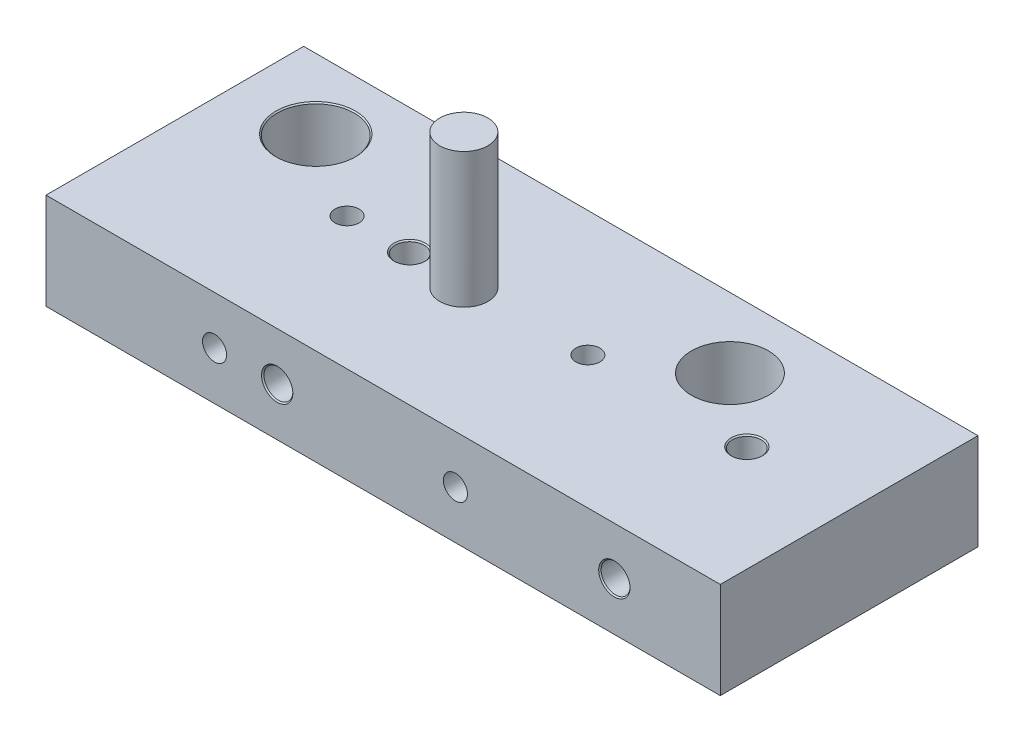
ISO-10303-21;
HEADER;
FILE_DESCRIPTION(('STEP AP214'),'2;1');
FILE_NAME('part.step','',(''),(''),'','','');
FILE_SCHEMA(('AUTOMOTIVE_DESIGN { 1 0 10303 214 1 1 1 1 }'));
ENDSEC;
DATA;
#1=APPLICATION_CONTEXT('core data for automotive mechanical design processes');
#2=APPLICATION_PROTOCOL_DEFINITION('international standard','automotive_design',2000,#1);
#3=PRODUCT_CONTEXT('',#1,'mechanical');
#4=PRODUCT('Part','Part','',(#3));
#5=PRODUCT_RELATED_PRODUCT_CATEGORY('part','',(#4));
#6=PRODUCT_DEFINITION_FORMATION('','',#4);
#7=PRODUCT_DEFINITION_CONTEXT('part definition',#1,'design');
#8=PRODUCT_DEFINITION('design','',#6,#7);
#9=PRODUCT_DEFINITION_SHAPE('','',#8);
#10=(LENGTH_UNIT() NAMED_UNIT(*) SI_UNIT(.MILLI.,.METRE.));
#11=(NAMED_UNIT(*) PLANE_ANGLE_UNIT() SI_UNIT($,.RADIAN.));
#12=(NAMED_UNIT(*) SI_UNIT($,.STERADIAN.) SOLID_ANGLE_UNIT());
#13=UNCERTAINTY_MEASURE_WITH_UNIT(LENGTH_MEASURE(1.E-05),#10,'distance_accuracy_value','');
#14=(GEOMETRIC_REPRESENTATION_CONTEXT(3) GLOBAL_UNCERTAINTY_ASSIGNED_CONTEXT((#13)) GLOBAL_UNIT_ASSIGNED_CONTEXT((#10,
#11,#12)) REPRESENTATION_CONTEXT('',''));
#15=CARTESIAN_POINT('',(0.,0.,0.));
#16=DIRECTION('',(0.,0.,1.));
#17=DIRECTION('',(1.,0.,0.));
#18=AXIS2_PLACEMENT_3D('',#15,#16,#17);
#19=CARTESIAN_POINT('',(0.,20.,-53.5));
#20=DIRECTION('',(0.,-1.,0.));
#21=DIRECTION('',(0.,0.,-1.));
#22=AXIS2_PLACEMENT_3D('',#19,#20,#21);
#23=PLANE('',#22);
#24=CARTESIAN_POINT('',(103.,20.,-39.));
#25=DIRECTION('',(0.,-1.,0.));
#26=DIRECTION('',(0.,0.,-1.));
#27=AXIS2_PLACEMENT_3D('',#24,#25,#26);
#28=CIRCLE('',#27,7.99999999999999);
#29=CARTESIAN_POINT('',(103.,20.,-47.));
#30=VERTEX_POINT('',#29);
#31=EDGE_CURVE('E9178',#30,#30,#28,.T.);
#32=ORIENTED_EDGE('',*,*,#31,.T.);
#33=EDGE_LOOP('',(#32));
#34=FACE_BOUND('',#33,.T.);
#35=DIRECTION('',(0.,0.,1.));
#36=VECTOR('',#35,1.);
#37=CARTESIAN_POINT('',(0.,20.,0.));
#38=LINE('',#37,#36);
#39=CARTESIAN_POINT('',(0.,20.,-53.5));
#40=VERTEX_POINT('',#39);
#41=CARTESIAN_POINT('',(0.,20.,0.));
#42=VERTEX_POINT('',#41);
#43=EDGE_CURVE('E9306',#40,#42,#38,.T.);
#44=ORIENTED_EDGE('',*,*,#43,.T.);
#45=DIRECTION('',(1.,0.,0.));
#46=VECTOR('',#45,1.);
#47=CARTESIAN_POINT('',(0.,20.,0.));
#48=LINE('',#47,#46);
#49=CARTESIAN_POINT('',(140.,20.,0.));
#50=VERTEX_POINT('',#49);
#51=EDGE_CURVE('E9304',#42,#50,#48,.T.);
#52=ORIENTED_EDGE('',*,*,#51,.T.);
#53=DIRECTION('',(0.,0.,-1.));
#54=VECTOR('',#53,1.);
#55=CARTESIAN_POINT('',(140.,20.,0.));
#56=LINE('',#55,#54);
#57=CARTESIAN_POINT('',(140.,20.,-53.5));
#58=VERTEX_POINT('',#57);
#59=EDGE_CURVE('E9302',#50,#58,#56,.T.);
#60=ORIENTED_EDGE('',*,*,#59,.T.);
#61=DIRECTION('',(-1.,0.,0.));
#62=VECTOR('',#61,1.);
#63=CARTESIAN_POINT('',(0.,20.,-53.5));
#64=LINE('',#63,#62);
#65=EDGE_CURVE('E9300',#58,#40,#64,.T.);
#66=ORIENTED_EDGE('',*,*,#65,.T.);
#67=EDGE_LOOP('',(#44,#52,#60,#66));
#68=FACE_BOUND('',#67,.T.);
#69=CARTESIAN_POINT('',(17.,20.,-39.));
#70=DIRECTION('',(0.,-1.,0.));
#71=DIRECTION('',(0.,0.,-1.));
#72=AXIS2_PLACEMENT_3D('',#69,#70,#71);
#73=CIRCLE('',#72,8.24999999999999);
#74=CARTESIAN_POINT('',(17.,20.,-47.25));
#75=VERTEX_POINT('',#74);
#76=EDGE_CURVE('E9327',#75,#75,#73,.T.);
#77=ORIENTED_EDGE('',*,*,#76,.T.);
#78=EDGE_LOOP('',(#77));
#79=FACE_BOUND('',#78,.T.);
#80=CARTESIAN_POINT('',(35.,20.,-27.5));
#81=DIRECTION('',(0.,-1.,0.));
#82=DIRECTION('',(0.,0.,-1.));
#83=AXIS2_PLACEMENT_3D('',#80,#81,#82);
#84=CIRCLE('',#83,2.5);
#85=CARTESIAN_POINT('',(35.,20.,-30.));
#86=VERTEX_POINT('',#85);
#87=EDGE_CURVE('E9333',#86,#86,#84,.T.);
#88=ORIENTED_EDGE('',*,*,#87,.T.);
#89=EDGE_LOOP('',(#88));
#90=FACE_BOUND('',#89,.T.);
#91=CARTESIAN_POINT('',(85.,20.,-27.5));
#92=DIRECTION('',(0.,-1.,0.));
#93=DIRECTION('',(0.,0.,-1.));
#94=AXIS2_PLACEMENT_3D('',#91,#92,#93);
#95=CIRCLE('',#94,2.49999999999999);
#96=CARTESIAN_POINT('',(85.,20.,-30.));
#97=VERTEX_POINT('',#96);
#98=EDGE_CURVE('E9339',#97,#97,#95,.T.);
#99=ORIENTED_EDGE('',*,*,#98,.T.);
#100=EDGE_LOOP('',(#99));
#101=FACE_BOUND('',#100,.T.);
#102=CARTESIAN_POINT('',(48.,20.,-27.5));
#103=DIRECTION('',(0.,-1.,0.));
#104=DIRECTION('',(0.,0.,-1.));
#105=AXIS2_PLACEMENT_3D('',#102,#103,#104);
#106=CIRCLE('',#105,3.25);
#107=CARTESIAN_POINT('',(48.,20.,-30.75));
#108=VERTEX_POINT('',#107);
#109=EDGE_CURVE('E9351',#108,#108,#106,.T.);
#110=ORIENTED_EDGE('',*,*,#109,.T.);
#111=EDGE_LOOP('',(#110));
#112=FACE_BOUND('',#111,.T.);
#113=CARTESIAN_POINT('',(118.,20.,-27.5));
#114=DIRECTION('',(0.,-1.,0.));
#115=DIRECTION('',(0.,0.,-1.));
#116=AXIS2_PLACEMENT_3D('',#113,#114,#115);
#117=CIRCLE('',#116,3.24999999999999);
#118=CARTESIAN_POINT('',(118.,20.,-30.75));
#119=VERTEX_POINT('',#118);
#120=EDGE_CURVE('E9363',#119,#119,#117,.T.);
#121=ORIENTED_EDGE('',*,*,#120,.T.);
#122=EDGE_LOOP('',(#121));
#123=FACE_BOUND('',#122,.T.);
#124=CARTESIAN_POINT('',(60.,20.,-26.75));
#125=DIRECTION('',(0.,-1.,0.));
#126=DIRECTION('',(0.,0.,-1.));
#127=AXIS2_PLACEMENT_3D('',#124,#125,#126);
#128=CIRCLE('',#127,5.);
#129=CARTESIAN_POINT('',(60.,20.,-31.75));
#130=VERTEX_POINT('',#129);
#131=EDGE_CURVE('E11',#130,#130,#128,.F.);
#132=ORIENTED_EDGE('',*,*,#131,.F.);
#133=EDGE_LOOP('',(#132));
#134=FACE_BOUND('',#133,.T.);
#135=ADVANCED_FACE('F9174',(#34,#68,#79,#90,#101,#112,#123,#134),#23,.F.);
#136=CARTESIAN_POINT('',(85.,0.,-27.5));
#137=DIRECTION('',(0.,-1.,0.));
#138=DIRECTION('',(0.,0.,-1.));
#139=AXIS2_PLACEMENT_3D('',#136,#137,#138);
#140=CYLINDRICAL_SURFACE('',#139,2.49999999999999);
#141=CARTESIAN_POINT('',(85.,0.,-27.5));
#142=DIRECTION('',(0.,-1.,0.));
#143=DIRECTION('',(0.,0.,-1.));
#144=AXIS2_PLACEMENT_3D('',#141,#142,#143);
#145=CIRCLE('',#144,2.49999999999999);
#146=CARTESIAN_POINT('',(85.,0.,-30.));
#147=VERTEX_POINT('',#146);
#148=EDGE_CURVE('E9336',#147,#147,#145,.T.);
#149=ORIENTED_EDGE('',*,*,#148,.T.);
#150=EDGE_LOOP('',(#149));
#151=FACE_BOUND('',#150,.T.);
#152=CARTESIAN_POINT('',(85.,10.,-27.5));
#153=DIRECTION('',(0.,-0.707106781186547,-0.707106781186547));
#154=DIRECTION('',(0.,-0.707106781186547,0.707106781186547));
#155=AXIS2_PLACEMENT_3D('',#152,#153,#154);
#156=ELLIPSE('',#155,3.53553390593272,2.49999999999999);
#157=CARTESIAN_POINT('',(82.5,10.,-27.5));
#158=VERTEX_POINT('',#157);
#159=CARTESIAN_POINT('',(87.5,10.,-27.5));
#160=VERTEX_POINT('',#159);
#161=EDGE_CURVE('E9189',#158,#160,#156,.F.);
#162=ORIENTED_EDGE('',*,*,#161,.T.);
#163=CARTESIAN_POINT('',(85.,10.,-27.5));
#164=DIRECTION('',(0.,-0.707106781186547,0.707106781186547));
#165=DIRECTION('',(0.,-0.707106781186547,-0.707106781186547));
#166=AXIS2_PLACEMENT_3D('',#163,#164,#165);
#167=ELLIPSE('',#166,3.53553390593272,2.49999999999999);
#168=EDGE_CURVE('E9183',#160,#158,#167,.F.);
#169=ORIENTED_EDGE('',*,*,#168,.T.);
#170=EDGE_LOOP('',(#162,#169));
#171=FACE_BOUND('',#170,.T.);
#172=ADVANCED_FACE('F9252',(#151,#171),#140,.F.);
#173=CARTESIAN_POINT('',(35.,0.,-27.5));
#174=DIRECTION('',(0.,-1.,0.));
#175=DIRECTION('',(0.,0.,-1.));
#176=AXIS2_PLACEMENT_3D('',#173,#174,#175);
#177=CYLINDRICAL_SURFACE('',#176,2.49999999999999);
#178=CARTESIAN_POINT('',(35.,0.,-27.5));
#179=DIRECTION('',(0.,-1.,0.));
#180=DIRECTION('',(0.,0.,-1.));
#181=AXIS2_PLACEMENT_3D('',#178,#179,#180);
#182=CIRCLE('',#181,2.49999999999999);
#183=CARTESIAN_POINT('',(35.,0.,-30.));
#184=VERTEX_POINT('',#183);
#185=EDGE_CURVE('E9330',#184,#184,#182,.T.);
#186=ORIENTED_EDGE('',*,*,#185,.T.);
#187=EDGE_LOOP('',(#186));
#188=FACE_BOUND('',#187,.T.);
#189=CARTESIAN_POINT('',(35.,10.,-27.5));
#190=DIRECTION('',(0.,-0.707106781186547,-0.707106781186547));
#191=DIRECTION('',(0.,-0.707106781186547,0.707106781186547));
#192=AXIS2_PLACEMENT_3D('',#189,#190,#191);
#193=ELLIPSE('',#192,3.53553390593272,2.49999999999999);
#194=CARTESIAN_POINT('',(32.5,10.,-27.5));
#195=VERTEX_POINT('',#194);
#196=CARTESIAN_POINT('',(37.5,10.,-27.5));
#197=VERTEX_POINT('',#196);
#198=EDGE_CURVE('E9196',#195,#197,#193,.F.);
#199=ORIENTED_EDGE('',*,*,#198,.T.);
#200=CARTESIAN_POINT('',(35.,10.,-27.5));
#201=DIRECTION('',(0.,-0.707106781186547,0.707106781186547));
#202=DIRECTION('',(0.,-0.707106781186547,-0.707106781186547));
#203=AXIS2_PLACEMENT_3D('',#200,#201,#202);
#204=ELLIPSE('',#203,3.53553390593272,2.49999999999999);
#205=EDGE_CURVE('E9250',#197,#195,#204,.F.);
#206=ORIENTED_EDGE('',*,*,#205,.T.);
#207=EDGE_LOOP('',(#199,#206));
#208=FACE_BOUND('',#207,.T.);
#209=ADVANCED_FACE('F9549',(#188,#208),#177,.F.);
#210=CARTESIAN_POINT('',(118.,0.,-27.5));
#211=DIRECTION('',(0.,-1.,0.));
#212=DIRECTION('',(0.,0.,-1.));
#213=AXIS2_PLACEMENT_3D('',#210,#211,#212);
#214=CYLINDRICAL_SURFACE('',#213,3.);
#215=CARTESIAN_POINT('',(118.,0.250000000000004,-27.5));
#216=DIRECTION('',(0.,-1.,0.));
#217=DIRECTION('',(0.,0.,-1.));
#218=AXIS2_PLACEMENT_3D('',#215,#216,#217);
#219=CIRCLE('',#218,3.);
#220=CARTESIAN_POINT('',(118.,0.250000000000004,-30.5));
#221=VERTEX_POINT('',#220);
#222=EDGE_CURVE('E9357',#221,#221,#219,.T.);
#223=ORIENTED_EDGE('',*,*,#222,.T.);
#224=EDGE_LOOP('',(#223));
#225=FACE_BOUND('',#224,.T.);
#226=CARTESIAN_POINT('',(118.,10.,-27.5));
#227=DIRECTION('',(0.,-0.707106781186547,-0.707106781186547));
#228=DIRECTION('',(0.,-0.707106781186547,0.707106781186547));
#229=AXIS2_PLACEMENT_3D('',#226,#227,#228);
#230=ELLIPSE('',#229,4.24264068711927,2.99999999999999);
#231=CARTESIAN_POINT('',(115.,10.,-27.5));
#232=VERTEX_POINT('',#231);
#233=CARTESIAN_POINT('',(121.,10.,-27.5));
#234=VERTEX_POINT('',#233);
#235=EDGE_CURVE('E9275',#232,#234,#230,.F.);
#236=ORIENTED_EDGE('',*,*,#235,.T.);
#237=CARTESIAN_POINT('',(118.,10.,-27.5));
#238=DIRECTION('',(0.,-0.707106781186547,0.707106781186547));
#239=DIRECTION('',(0.,-0.707106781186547,-0.707106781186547));
#240=AXIS2_PLACEMENT_3D('',#237,#238,#239);
#241=ELLIPSE('',#240,4.24264068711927,2.99999999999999);
#242=EDGE_CURVE('E9266',#234,#232,#241,.F.);
#243=ORIENTED_EDGE('',*,*,#242,.T.);
#244=EDGE_LOOP('',(#236,#243));
#245=FACE_BOUND('',#244,.T.);
#246=ADVANCED_FACE('F9525',(#225,#245),#214,.F.);
#247=CARTESIAN_POINT('',(48.,0.,-27.5));
#248=DIRECTION('',(0.,-1.,0.));
#249=DIRECTION('',(0.,0.,-1.));
#250=AXIS2_PLACEMENT_3D('',#247,#248,#249);
#251=CYLINDRICAL_SURFACE('',#250,3.);
#252=CARTESIAN_POINT('',(48.,0.250000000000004,-27.5));
#253=DIRECTION('',(0.,-1.,0.));
#254=DIRECTION('',(0.,0.,-1.));
#255=AXIS2_PLACEMENT_3D('',#252,#253,#254);
#256=CIRCLE('',#255,3.);
#257=CARTESIAN_POINT('',(48.,0.250000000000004,-30.5));
#258=VERTEX_POINT('',#257);
#259=EDGE_CURVE('E9345',#258,#258,#256,.T.);
#260=ORIENTED_EDGE('',*,*,#259,.T.);
#261=EDGE_LOOP('',(#260));
#262=FACE_BOUND('',#261,.T.);
#263=CARTESIAN_POINT('',(48.,10.,-27.5));
#264=DIRECTION('',(0.,-0.707106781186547,-0.707106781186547));
#265=DIRECTION('',(0.,-0.707106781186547,0.707106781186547));
#266=AXIS2_PLACEMENT_3D('',#263,#264,#265);
#267=ELLIPSE('',#266,4.24264068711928,2.99999999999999);
#268=CARTESIAN_POINT('',(45.,10.,-27.5));
#269=VERTEX_POINT('',#268);
#270=CARTESIAN_POINT('',(51.,10.,-27.5));
#271=VERTEX_POINT('',#270);
#272=EDGE_CURVE('E9286',#269,#271,#267,.F.);
#273=ORIENTED_EDGE('',*,*,#272,.T.);
#274=CARTESIAN_POINT('',(48.,10.,-27.5));
#275=DIRECTION('',(0.,-0.707106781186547,0.707106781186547));
#276=DIRECTION('',(0.,-0.707106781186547,-0.707106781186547));
#277=AXIS2_PLACEMENT_3D('',#274,#275,#276);
#278=ELLIPSE('',#277,4.24264068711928,2.99999999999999);
#279=EDGE_CURVE('E9277',#271,#269,#278,.F.);
#280=ORIENTED_EDGE('',*,*,#279,.T.);
#281=EDGE_LOOP('',(#273,#280));
#282=FACE_BOUND('',#281,.T.);
#283=ADVANCED_FACE('F9538',(#262,#282),#251,.F.);
#284=CARTESIAN_POINT('',(0.,20.,0.));
#285=DIRECTION('',(1.,0.,0.));
#286=DIRECTION('',(0.,0.,-1.));
#287=AXIS2_PLACEMENT_3D('',#284,#285,#286);
#288=PLANE('',#287);
#289=DIRECTION('',(0.,0.,1.));
#290=VECTOR('',#289,1.);
#291=CARTESIAN_POINT('',(0.,0.,0.));
#292=LINE('',#291,#290);
#293=CARTESIAN_POINT('',(0.,0.,-53.5));
#294=VERTEX_POINT('',#293);
#295=CARTESIAN_POINT('',(0.,0.,0.));
#296=VERTEX_POINT('',#295);
#297=EDGE_CURVE('E9315',#294,#296,#292,.T.);
#298=ORIENTED_EDGE('',*,*,#297,.T.);
#299=DIRECTION('',(0.,-1.,0.));
#300=VECTOR('',#299,1.);
#301=CARTESIAN_POINT('',(0.,20.,0.));
#302=LINE('',#301,#300);
#303=EDGE_CURVE('E9288',#42,#296,#302,.T.);
#304=ORIENTED_EDGE('',*,*,#303,.F.);
#305=ORIENTED_EDGE('',*,*,#43,.F.);
#306=DIRECTION('',(0.,-1.,0.));
#307=VECTOR('',#306,1.);
#308=CARTESIAN_POINT('',(0.,20.,-53.5));
#309=LINE('',#308,#307);
#310=EDGE_CURVE('E9297',#40,#294,#309,.T.);
#311=ORIENTED_EDGE('',*,*,#310,.T.);
#312=EDGE_LOOP('',(#298,#304,#305,#311));
#313=FACE_BOUND('',#312,.T.);
#314=ADVANCED_FACE('F9176',(#313),#288,.F.);
#315=CARTESIAN_POINT('',(0.,20.,0.));
#316=DIRECTION('',(0.,0.,-1.));
#317=DIRECTION('',(-1.,0.,0.));
#318=AXIS2_PLACEMENT_3D('',#315,#316,#317);
#319=PLANE('',#318);
#320=CARTESIAN_POINT('',(85.,10.,0.));
#321=DIRECTION('',(0.,0.,1.));
#322=DIRECTION('',(1.,0.,0.));
#323=AXIS2_PLACEMENT_3D('',#320,#321,#322);
#324=CIRCLE('',#323,2.49999999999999);
#325=CARTESIAN_POINT('',(87.5,10.,0.));
#326=VERTEX_POINT('',#325);
#327=EDGE_CURVE('E9396',#326,#326,#324,.T.);
#328=ORIENTED_EDGE('',*,*,#327,.F.);
#329=EDGE_LOOP('',(#328));
#330=FACE_BOUND('',#329,.T.);
#331=CARTESIAN_POINT('',(35.,10.,0.));
#332=DIRECTION('',(0.,0.,1.));
#333=DIRECTION('',(1.,0.,0.));
#334=AXIS2_PLACEMENT_3D('',#331,#332,#333);
#335=CIRCLE('',#334,2.49999999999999);
#336=CARTESIAN_POINT('',(37.5,10.,0.));
#337=VERTEX_POINT('',#336);
#338=EDGE_CURVE('E9390',#337,#337,#335,.T.);
#339=ORIENTED_EDGE('',*,*,#338,.F.);
#340=EDGE_LOOP('',(#339));
#341=FACE_BOUND('',#340,.T.);
#342=CARTESIAN_POINT('',(118.,10.,0.));
#343=DIRECTION('',(0.,0.,1.));
#344=DIRECTION('',(1.,0.,0.));
#345=AXIS2_PLACEMENT_3D('',#342,#343,#344);
#346=CIRCLE('',#345,3.25);
#347=CARTESIAN_POINT('',(121.25,10.,0.));
#348=VERTEX_POINT('',#347);
#349=EDGE_CURVE('E9378',#348,#348,#346,.T.);
#350=ORIENTED_EDGE('',*,*,#349,.F.);
#351=EDGE_LOOP('',(#350));
#352=FACE_BOUND('',#351,.T.);
#353=CARTESIAN_POINT('',(48.,10.,0.));
#354=DIRECTION('',(0.,0.,1.));
#355=DIRECTION('',(1.,0.,0.));
#356=AXIS2_PLACEMENT_3D('',#353,#354,#355);
#357=CIRCLE('',#356,3.25);
#358=CARTESIAN_POINT('',(51.25,10.,0.));
#359=VERTEX_POINT('',#358);
#360=EDGE_CURVE('E9366',#359,#359,#357,.T.);
#361=ORIENTED_EDGE('',*,*,#360,.F.);
#362=EDGE_LOOP('',(#361));
#363=FACE_BOUND('',#362,.T.);
#364=DIRECTION('',(1.,0.,0.));
#365=VECTOR('',#364,1.);
#366=CARTESIAN_POINT('',(0.,0.,0.));
#367=LINE('',#366,#365);
#368=CARTESIAN_POINT('',(140.,0.,0.));
#369=VERTEX_POINT('',#368);
#370=EDGE_CURVE('E9313',#296,#369,#367,.T.);
#371=ORIENTED_EDGE('',*,*,#370,.T.);
#372=DIRECTION('',(0.,-1.,0.));
#373=VECTOR('',#372,1.);
#374=CARTESIAN_POINT('',(140.,20.,0.));
#375=LINE('',#374,#373);
#376=EDGE_CURVE('E9291',#50,#369,#375,.T.);
#377=ORIENTED_EDGE('',*,*,#376,.F.);
#378=ORIENTED_EDGE('',*,*,#51,.F.);
#379=ORIENTED_EDGE('',*,*,#303,.T.);
#380=EDGE_LOOP('',(#371,#377,#378,#379));
#381=FACE_BOUND('',#380,.T.);
#382=ADVANCED_FACE('F9452',(#330,#341,#352,#363,#381),#319,.F.);
#383=CARTESIAN_POINT('',(140.,20.,0.));
#384=DIRECTION('',(-1.,0.,0.));
#385=DIRECTION('',(0.,0.,1.));
#386=AXIS2_PLACEMENT_3D('',#383,#384,#385);
#387=PLANE('',#386);
#388=DIRECTION('',(0.,0.,-1.));
#389=VECTOR('',#388,1.);
#390=CARTESIAN_POINT('',(140.,0.,0.));
#391=LINE('',#390,#389);
#392=CARTESIAN_POINT('',(140.,0.,-53.5));
#393=VERTEX_POINT('',#392);
#394=EDGE_CURVE('E9311',#369,#393,#391,.T.);
#395=ORIENTED_EDGE('',*,*,#394,.T.);
#396=DIRECTION('',(0.,-1.,0.));
#397=VECTOR('',#396,1.);
#398=CARTESIAN_POINT('',(140.,20.,-53.5));
#399=LINE('',#398,#397);
#400=EDGE_CURVE('E9294',#58,#393,#399,.T.);
#401=ORIENTED_EDGE('',*,*,#400,.F.);
#402=ORIENTED_EDGE('',*,*,#59,.F.);
#403=ORIENTED_EDGE('',*,*,#376,.T.);
#404=EDGE_LOOP('',(#395,#401,#402,#403));
#405=FACE_BOUND('',#404,.T.);
#406=ADVANCED_FACE('F9449',(#405),#387,.F.);
#407=CARTESIAN_POINT('',(0.,20.,-53.5));
#408=DIRECTION('',(0.,0.,1.));
#409=DIRECTION('',(1.,0.,0.));
#410=AXIS2_PLACEMENT_3D('',#407,#408,#409);
#411=PLANE('',#410);
#412=CARTESIAN_POINT('',(85.,10.,-53.5));
#413=DIRECTION('',(0.,0.,1.));
#414=DIRECTION('',(1.,0.,0.));
#415=AXIS2_PLACEMENT_3D('',#412,#413,#414);
#416=CIRCLE('',#415,2.49999999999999);
#417=CARTESIAN_POINT('',(87.5,10.,-53.5));
#418=VERTEX_POINT('',#417);
#419=EDGE_CURVE('E9399',#418,#418,#416,.T.);
#420=ORIENTED_EDGE('',*,*,#419,.T.);
#421=EDGE_LOOP('',(#420));
#422=FACE_BOUND('',#421,.T.);
#423=CARTESIAN_POINT('',(35.,10.,-53.5));
#424=DIRECTION('',(0.,0.,1.));
#425=DIRECTION('',(1.,0.,0.));
#426=AXIS2_PLACEMENT_3D('',#423,#424,#425);
#427=CIRCLE('',#426,2.49999999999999);
#428=CARTESIAN_POINT('',(37.5,10.,-53.5));
#429=VERTEX_POINT('',#428);
#430=EDGE_CURVE('E9393',#429,#429,#427,.T.);
#431=ORIENTED_EDGE('',*,*,#430,.T.);
#432=EDGE_LOOP('',(#431));
#433=FACE_BOUND('',#432,.T.);
#434=CARTESIAN_POINT('',(118.,10.,-53.5));
#435=DIRECTION('',(0.,0.,1.));
#436=DIRECTION('',(1.,0.,0.));
#437=AXIS2_PLACEMENT_3D('',#434,#435,#436);
#438=CIRCLE('',#437,3.24999999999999);
#439=CARTESIAN_POINT('',(121.25,10.,-53.5));
#440=VERTEX_POINT('',#439);
#441=EDGE_CURVE('E9387',#440,#440,#438,.T.);
#442=ORIENTED_EDGE('',*,*,#441,.T.);
#443=EDGE_LOOP('',(#442));
#444=FACE_BOUND('',#443,.T.);
#445=CARTESIAN_POINT('',(48.,10.,-53.5));
#446=DIRECTION('',(0.,0.,1.));
#447=DIRECTION('',(1.,0.,0.));
#448=AXIS2_PLACEMENT_3D('',#445,#446,#447);
#449=CIRCLE('',#448,3.24999999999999);
#450=CARTESIAN_POINT('',(51.25,10.,-53.5));
#451=VERTEX_POINT('',#450);
#452=EDGE_CURVE('E9375',#451,#451,#449,.T.);
#453=ORIENTED_EDGE('',*,*,#452,.T.);
#454=EDGE_LOOP('',(#453));
#455=FACE_BOUND('',#454,.T.);
#456=DIRECTION('',(-1.,0.,0.));
#457=VECTOR('',#456,1.);
#458=CARTESIAN_POINT('',(0.,0.,-53.5));
#459=LINE('',#458,#457);
#460=EDGE_CURVE('E9309',#393,#294,#459,.T.);
#461=ORIENTED_EDGE('',*,*,#460,.T.);
#462=ORIENTED_EDGE('',*,*,#310,.F.);
#463=ORIENTED_EDGE('',*,*,#65,.F.);
#464=ORIENTED_EDGE('',*,*,#400,.T.);
#465=EDGE_LOOP('',(#461,#462,#463,#464));
#466=FACE_BOUND('',#465,.T.);
#467=ADVANCED_FACE('F9425',(#422,#433,#444,#455,#466),#411,.F.);
#468=CARTESIAN_POINT('',(0.,0.,-53.5));
#469=DIRECTION('',(0.,-1.,0.));
#470=DIRECTION('',(0.,0.,-1.));
#471=AXIS2_PLACEMENT_3D('',#468,#469,#470);
#472=PLANE('',#471);
#473=CARTESIAN_POINT('',(103.,0.,-39.));
#474=DIRECTION('',(0.,-1.,0.));
#475=DIRECTION('',(0.,0.,-1.));
#476=AXIS2_PLACEMENT_3D('',#473,#474,#475);
#477=CIRCLE('',#476,8.25000000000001);
#478=CARTESIAN_POINT('',(103.,0.,-47.25));
#479=VERTEX_POINT('',#478);
#480=EDGE_CURVE('E9405',#479,#479,#477,.T.);
#481=ORIENTED_EDGE('',*,*,#480,.F.);
#482=EDGE_LOOP('',(#481));
#483=FACE_BOUND('',#482,.T.);
#484=CARTESIAN_POINT('',(118.,0.,-27.5));
#485=DIRECTION('',(0.,-1.,0.));
#486=DIRECTION('',(0.,0.,-1.));
#487=AXIS2_PLACEMENT_3D('',#484,#485,#486);
#488=CIRCLE('',#487,3.25);
#489=CARTESIAN_POINT('',(118.,0.,-30.75));
#490=VERTEX_POINT('',#489);
#491=EDGE_CURVE('E9354',#490,#490,#488,.T.);
#492=ORIENTED_EDGE('',*,*,#491,.F.);
#493=EDGE_LOOP('',(#492));
#494=FACE_BOUND('',#493,.T.);
#495=CARTESIAN_POINT('',(48.,0.,-27.5));
#496=DIRECTION('',(0.,-1.,0.));
#497=DIRECTION('',(0.,0.,-1.));
#498=AXIS2_PLACEMENT_3D('',#495,#496,#497);
#499=CIRCLE('',#498,3.25);
#500=CARTESIAN_POINT('',(48.,0.,-30.75));
#501=VERTEX_POINT('',#500);
#502=EDGE_CURVE('E9342',#501,#501,#499,.T.);
#503=ORIENTED_EDGE('',*,*,#502,.F.);
#504=EDGE_LOOP('',(#503));
#505=FACE_BOUND('',#504,.T.);
#506=ORIENTED_EDGE('',*,*,#148,.F.);
#507=EDGE_LOOP('',(#506));
#508=FACE_BOUND('',#507,.T.);
#509=ORIENTED_EDGE('',*,*,#185,.F.);
#510=EDGE_LOOP('',(#509));
#511=FACE_BOUND('',#510,.T.);
#512=CARTESIAN_POINT('',(17.,0.,-39.));
#513=DIRECTION('',(0.,-1.,0.));
#514=DIRECTION('',(0.,0.,-1.));
#515=AXIS2_PLACEMENT_3D('',#512,#513,#514);
#516=CIRCLE('',#515,8.25);
#517=CARTESIAN_POINT('',(17.,0.,-47.25));
#518=VERTEX_POINT('',#517);
#519=EDGE_CURVE('E9318',#518,#518,#516,.T.);
#520=ORIENTED_EDGE('',*,*,#519,.F.);
#521=EDGE_LOOP('',(#520));
#522=FACE_BOUND('',#521,.T.);
#523=ORIENTED_EDGE('',*,*,#297,.F.);
#524=ORIENTED_EDGE('',*,*,#460,.F.);
#525=ORIENTED_EDGE('',*,*,#394,.F.);
#526=ORIENTED_EDGE('',*,*,#370,.F.);
#527=EDGE_LOOP('',(#523,#524,#525,#526));
#528=FACE_BOUND('',#527,.T.);
#529=ADVANCED_FACE('F9421',(#483,#494,#505,#508,#511,#522,#528),#472,.T.);
#530=CARTESIAN_POINT('',(17.,0.,-39.));
#531=DIRECTION('',(0.,-1.,0.));
#532=DIRECTION('',(0.,0.,-1.));
#533=AXIS2_PLACEMENT_3D('',#530,#531,#532);
#534=CONICAL_SURFACE('',#533,8.25,0.785398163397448);
#535=CARTESIAN_POINT('',(17.,0.250000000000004,-39.));
#536=DIRECTION('',(0.,-1.,0.));
#537=DIRECTION('',(0.,0.,-1.));
#538=AXIS2_PLACEMENT_3D('',#535,#536,#537);
#539=CIRCLE('',#538,8.);
#540=CARTESIAN_POINT('',(17.,0.250000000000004,-47.));
#541=VERTEX_POINT('',#540);
#542=EDGE_CURVE('E9321',#541,#541,#539,.T.);
#543=ORIENTED_EDGE('',*,*,#542,.F.);
#544=EDGE_LOOP('',(#543));
#545=FACE_BOUND('',#544,.T.);
#546=ORIENTED_EDGE('',*,*,#519,.T.);
#547=EDGE_LOOP('',(#546));
#548=FACE_BOUND('',#547,.T.);
#549=ADVANCED_FACE('F9424',(#545,#548),#534,.F.);
#550=CARTESIAN_POINT('',(17.,0.,-39.));
#551=DIRECTION('',(0.,-1.,0.));
#552=DIRECTION('',(0.,0.,-1.));
#553=AXIS2_PLACEMENT_3D('',#550,#551,#552);
#554=CYLINDRICAL_SURFACE('',#553,7.99999999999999);
#555=CARTESIAN_POINT('',(17.,19.75,-39.));
#556=DIRECTION('',(0.,-1.,0.));
#557=DIRECTION('',(0.,0.,-1.));
#558=AXIS2_PLACEMENT_3D('',#555,#556,#557);
#559=CIRCLE('',#558,7.99999999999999);
#560=CARTESIAN_POINT('',(17.,19.75,-47.));
#561=VERTEX_POINT('',#560);
#562=EDGE_CURVE('E9324',#561,#561,#559,.T.);
#563=ORIENTED_EDGE('',*,*,#562,.F.);
#564=EDGE_LOOP('',(#563));
#565=FACE_BOUND('',#564,.T.);
#566=ORIENTED_EDGE('',*,*,#542,.T.);
#567=EDGE_LOOP('',(#566));
#568=FACE_BOUND('',#567,.T.);
#569=ADVANCED_FACE('F9552',(#565,#568),#554,.F.);
#570=CARTESIAN_POINT('',(17.,19.75,-39.));
#571=DIRECTION('',(0.,1.,0.));
#572=DIRECTION('',(0.,0.,1.));
#573=AXIS2_PLACEMENT_3D('',#570,#571,#572);
#574=CONICAL_SURFACE('',#573,7.99999999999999,0.785398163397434);
#575=ORIENTED_EDGE('',*,*,#76,.F.);
#576=EDGE_LOOP('',(#575));
#577=FACE_BOUND('',#576,.T.);
#578=ORIENTED_EDGE('',*,*,#562,.T.);
#579=EDGE_LOOP('',(#578));
#580=FACE_BOUND('',#579,.T.);
#581=ADVANCED_FACE('F9547',(#577,#580),#574,.F.);
#582=CARTESIAN_POINT('',(35.,10.,-27.5));
#583=DIRECTION('',(0.,-0.707106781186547,-0.707106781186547));
#584=DIRECTION('',(0.,-0.707106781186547,0.707106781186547));
#585=AXIS2_PLACEMENT_3D('',#582,#583,#584);
#586=ELLIPSE('',#585,3.53553390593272,2.49999999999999);
#587=EDGE_CURVE('E9262',#195,#197,#586,.T.);
#588=ORIENTED_EDGE('',*,*,#587,.T.);
#589=CARTESIAN_POINT('',(35.,10.,-27.5));
#590=DIRECTION('',(0.,-0.707106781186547,0.707106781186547));
#591=DIRECTION('',(0.,-0.707106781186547,-0.707106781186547));
#592=AXIS2_PLACEMENT_3D('',#589,#590,#591);
#593=ELLIPSE('',#592,3.53553390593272,2.49999999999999);
#594=EDGE_CURVE('E9259',#197,#195,#593,.T.);
#595=ORIENTED_EDGE('',*,*,#594,.T.);
#596=EDGE_LOOP('',(#588,#595));
#597=FACE_BOUND('',#596,.T.);
#598=ORIENTED_EDGE('',*,*,#87,.F.);
#599=EDGE_LOOP('',(#598));
#600=FACE_BOUND('',#599,.T.);
#601=ADVANCED_FACE('F9544',(#597,#600),#177,.F.);
#602=CARTESIAN_POINT('',(85.,10.,-27.5));
#603=DIRECTION('',(0.,-0.707106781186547,-0.707106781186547));
#604=DIRECTION('',(0.,-0.707106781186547,0.707106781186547));
#605=AXIS2_PLACEMENT_3D('',#602,#603,#604);
#606=ELLIPSE('',#605,3.53553390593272,2.49999999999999);
#607=EDGE_CURVE('E9242',#158,#160,#606,.T.);
#608=ORIENTED_EDGE('',*,*,#607,.T.);
#609=CARTESIAN_POINT('',(85.,10.,-27.5));
#610=DIRECTION('',(0.,-0.707106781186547,0.707106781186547));
#611=DIRECTION('',(0.,-0.707106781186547,-0.707106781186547));
#612=AXIS2_PLACEMENT_3D('',#609,#610,#611);
#613=ELLIPSE('',#612,3.53553390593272,2.49999999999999);
#614=EDGE_CURVE('E9246',#160,#158,#613,.T.);
#615=ORIENTED_EDGE('',*,*,#614,.T.);
#616=EDGE_LOOP('',(#608,#615));
#617=FACE_BOUND('',#616,.T.);
#618=ORIENTED_EDGE('',*,*,#98,.F.);
#619=EDGE_LOOP('',(#618));
#620=FACE_BOUND('',#619,.T.);
#621=ADVANCED_FACE('F9254',(#617,#620),#140,.F.);
#622=CARTESIAN_POINT('',(48.,0.,-27.5));
#623=DIRECTION('',(0.,-1.,0.));
#624=DIRECTION('',(0.,0.,-1.));
#625=AXIS2_PLACEMENT_3D('',#622,#623,#624);
#626=CONICAL_SURFACE('',#625,3.25,0.785398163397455);
#627=ORIENTED_EDGE('',*,*,#259,.F.);
#628=EDGE_LOOP('',(#627));
#629=FACE_BOUND('',#628,.T.);
#630=ORIENTED_EDGE('',*,*,#502,.T.);
#631=EDGE_LOOP('',(#630));
#632=FACE_BOUND('',#631,.T.);
#633=ADVANCED_FACE('F9536',(#629,#632),#626,.F.);
#634=CARTESIAN_POINT('',(48.,10.,-27.5));
#635=DIRECTION('',(0.,-0.707106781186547,-0.707106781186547));
#636=DIRECTION('',(0.,-0.707106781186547,0.707106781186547));
#637=AXIS2_PLACEMENT_3D('',#634,#635,#636);
#638=ELLIPSE('',#637,4.24264068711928,2.99999999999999);
#639=EDGE_CURVE('E9283',#269,#271,#638,.T.);
#640=ORIENTED_EDGE('',*,*,#639,.T.);
#641=CARTESIAN_POINT('',(48.,10.,-27.5));
#642=DIRECTION('',(0.,-0.707106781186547,0.707106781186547));
#643=DIRECTION('',(0.,-0.707106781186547,-0.707106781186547));
#644=AXIS2_PLACEMENT_3D('',#641,#642,#643);
#645=ELLIPSE('',#644,4.24264068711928,2.99999999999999);
#646=EDGE_CURVE('E9280',#271,#269,#645,.T.);
#647=ORIENTED_EDGE('',*,*,#646,.T.);
#648=EDGE_LOOP('',(#640,#647));
#649=FACE_BOUND('',#648,.T.);
#650=CARTESIAN_POINT('',(48.,19.75,-27.5));
#651=DIRECTION('',(0.,-1.,0.));
#652=DIRECTION('',(0.,0.,-1.));
#653=AXIS2_PLACEMENT_3D('',#650,#651,#652);
#654=CIRCLE('',#653,3.);
#655=CARTESIAN_POINT('',(48.,19.75,-30.5));
#656=VERTEX_POINT('',#655);
#657=EDGE_CURVE('E9348',#656,#656,#654,.T.);
#658=ORIENTED_EDGE('',*,*,#657,.F.);
#659=EDGE_LOOP('',(#658));
#660=FACE_BOUND('',#659,.T.);
#661=ADVANCED_FACE('F9532',(#649,#660),#251,.F.);
#662=CARTESIAN_POINT('',(48.,19.75,-27.5));
#663=DIRECTION('',(0.,1.,0.));
#664=DIRECTION('',(0.,0.,1.));
#665=AXIS2_PLACEMENT_3D('',#662,#663,#664);
#666=CONICAL_SURFACE('',#665,3.,0.785398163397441);
#667=ORIENTED_EDGE('',*,*,#109,.F.);
#668=EDGE_LOOP('',(#667));
#669=FACE_BOUND('',#668,.T.);
#670=ORIENTED_EDGE('',*,*,#657,.T.);
#671=EDGE_LOOP('',(#670));
#672=FACE_BOUND('',#671,.T.);
#673=ADVANCED_FACE('F9528',(#669,#672),#666,.F.);
#674=CARTESIAN_POINT('',(118.,0.,-27.5));
#675=DIRECTION('',(0.,-1.,0.));
#676=DIRECTION('',(0.,0.,-1.));
#677=AXIS2_PLACEMENT_3D('',#674,#675,#676);
#678=CONICAL_SURFACE('',#677,3.25,0.785398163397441);
#679=ORIENTED_EDGE('',*,*,#222,.F.);
#680=EDGE_LOOP('',(#679));
#681=FACE_BOUND('',#680,.T.);
#682=ORIENTED_EDGE('',*,*,#491,.T.);
#683=EDGE_LOOP('',(#682));
#684=FACE_BOUND('',#683,.T.);
#685=ADVANCED_FACE('F9523',(#681,#684),#678,.F.);
#686=CARTESIAN_POINT('',(118.,10.,-27.5));
#687=DIRECTION('',(0.,-0.707106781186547,-0.707106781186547));
#688=DIRECTION('',(0.,-0.707106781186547,0.707106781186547));
#689=AXIS2_PLACEMENT_3D('',#686,#687,#688);
#690=ELLIPSE('',#689,4.24264068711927,2.99999999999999);
#691=EDGE_CURVE('E9272',#232,#234,#690,.T.);
#692=ORIENTED_EDGE('',*,*,#691,.T.);
#693=CARTESIAN_POINT('',(118.,10.,-27.5));
#694=DIRECTION('',(0.,-0.707106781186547,0.707106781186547));
#695=DIRECTION('',(0.,-0.707106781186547,-0.707106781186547));
#696=AXIS2_PLACEMENT_3D('',#693,#694,#695);
#697=ELLIPSE('',#696,4.24264068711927,2.99999999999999);
#698=EDGE_CURVE('E9269',#234,#232,#697,.T.);
#699=ORIENTED_EDGE('',*,*,#698,.T.);
#700=EDGE_LOOP('',(#692,#699));
#701=FACE_BOUND('',#700,.T.);
#702=CARTESIAN_POINT('',(118.,19.75,-27.5));
#703=DIRECTION('',(0.,-1.,0.));
#704=DIRECTION('',(0.,0.,-1.));
#705=AXIS2_PLACEMENT_3D('',#702,#703,#704);
#706=CIRCLE('',#705,2.99999999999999);
#707=CARTESIAN_POINT('',(118.,19.75,-30.5));
#708=VERTEX_POINT('',#707);
#709=EDGE_CURVE('E9360',#708,#708,#706,.T.);
#710=ORIENTED_EDGE('',*,*,#709,.F.);
#711=EDGE_LOOP('',(#710));
#712=FACE_BOUND('',#711,.T.);
#713=ADVANCED_FACE('F9519',(#701,#712),#214,.F.);
#714=CARTESIAN_POINT('',(118.,19.75,-27.5));
#715=DIRECTION('',(0.,1.,0.));
#716=DIRECTION('',(0.,0.,1.));
#717=AXIS2_PLACEMENT_3D('',#714,#715,#716);
#718=CONICAL_SURFACE('',#717,2.99999999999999,0.785398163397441);
#719=ORIENTED_EDGE('',*,*,#120,.F.);
#720=EDGE_LOOP('',(#719));
#721=FACE_BOUND('',#720,.T.);
#722=ORIENTED_EDGE('',*,*,#709,.T.);
#723=EDGE_LOOP('',(#722));
#724=FACE_BOUND('',#723,.T.);
#725=ADVANCED_FACE('F9516',(#721,#724),#718,.F.);
#726=CARTESIAN_POINT('',(48.,10.,0.));
#727=DIRECTION('',(0.,0.,1.));
#728=DIRECTION('',(1.,0.,0.));
#729=AXIS2_PLACEMENT_3D('',#726,#727,#728);
#730=CYLINDRICAL_SURFACE('',#729,2.99999999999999);
#731=CARTESIAN_POINT('',(48.,10.,-0.250000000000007));
#732=DIRECTION('',(0.,0.,1.));
#733=DIRECTION('',(1.,0.,0.));
#734=AXIS2_PLACEMENT_3D('',#731,#732,#733);
#735=CIRCLE('',#734,3.);
#736=CARTESIAN_POINT('',(51.,10.,-0.250000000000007));
#737=VERTEX_POINT('',#736);
#738=EDGE_CURVE('E9369',#737,#737,#735,.T.);
#739=ORIENTED_EDGE('',*,*,#738,.T.);
#740=EDGE_LOOP('',(#739));
#741=FACE_BOUND('',#740,.T.);
#742=ORIENTED_EDGE('',*,*,#272,.F.);
#743=ORIENTED_EDGE('',*,*,#646,.F.);
#744=EDGE_LOOP('',(#742,#743));
#745=FACE_BOUND('',#744,.T.);
#746=ADVANCED_FACE('F9512',(#741,#745),#730,.F.);
#747=CARTESIAN_POINT('',(48.,10.,0.));
#748=DIRECTION('',(0.,0.,1.));
#749=DIRECTION('',(1.,0.,0.));
#750=AXIS2_PLACEMENT_3D('',#747,#748,#749);
#751=CONICAL_SURFACE('',#750,3.25,0.785398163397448);
#752=ORIENTED_EDGE('',*,*,#738,.F.);
#753=EDGE_LOOP('',(#752));
#754=FACE_BOUND('',#753,.T.);
#755=ORIENTED_EDGE('',*,*,#360,.T.);
#756=EDGE_LOOP('',(#755));
#757=FACE_BOUND('',#756,.T.);
#758=ADVANCED_FACE('F9510',(#754,#757),#751,.F.);
#759=CARTESIAN_POINT('',(48.,10.,-53.25));
#760=DIRECTION('',(0.,0.,1.));
#761=DIRECTION('',(1.,0.,0.));
#762=AXIS2_PLACEMENT_3D('',#759,#760,#761);
#763=CIRCLE('',#762,2.99999999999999);
#764=CARTESIAN_POINT('',(51.,10.,-53.25));
#765=VERTEX_POINT('',#764);
#766=EDGE_CURVE('E9372',#765,#765,#763,.T.);
#767=ORIENTED_EDGE('',*,*,#766,.F.);
#768=EDGE_LOOP('',(#767));
#769=FACE_BOUND('',#768,.T.);
#770=ORIENTED_EDGE('',*,*,#639,.F.);
#771=ORIENTED_EDGE('',*,*,#279,.F.);
#772=EDGE_LOOP('',(#770,#771));
#773=FACE_BOUND('',#772,.T.);
#774=ADVANCED_FACE('F9506',(#769,#773),#730,.F.);
#775=CARTESIAN_POINT('',(48.,10.,-53.25));
#776=DIRECTION('',(0.,0.,-1.));
#777=DIRECTION('',(-1.,0.,0.));
#778=AXIS2_PLACEMENT_3D('',#775,#776,#777);
#779=CONICAL_SURFACE('',#778,2.99999999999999,0.785398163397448);
#780=ORIENTED_EDGE('',*,*,#452,.F.);
#781=EDGE_LOOP('',(#780));
#782=FACE_BOUND('',#781,.T.);
#783=ORIENTED_EDGE('',*,*,#766,.T.);
#784=EDGE_LOOP('',(#783));
#785=FACE_BOUND('',#784,.T.);
#786=ADVANCED_FACE('F9503',(#782,#785),#779,.F.);
#787=CARTESIAN_POINT('',(118.,10.,0.));
#788=DIRECTION('',(0.,0.,1.));
#789=DIRECTION('',(1.,0.,0.));
#790=AXIS2_PLACEMENT_3D('',#787,#788,#789);
#791=CYLINDRICAL_SURFACE('',#790,2.99999999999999);
#792=CARTESIAN_POINT('',(118.,10.,-0.250000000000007));
#793=DIRECTION('',(0.,0.,1.));
#794=DIRECTION('',(1.,0.,0.));
#795=AXIS2_PLACEMENT_3D('',#792,#793,#794);
#796=CIRCLE('',#795,2.99999999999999);
#797=CARTESIAN_POINT('',(121.,10.,-0.250000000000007));
#798=VERTEX_POINT('',#797);
#799=EDGE_CURVE('E9381',#798,#798,#796,.T.);
#800=ORIENTED_EDGE('',*,*,#799,.T.);
#801=EDGE_LOOP('',(#800));
#802=FACE_BOUND('',#801,.T.);
#803=ORIENTED_EDGE('',*,*,#235,.F.);
#804=ORIENTED_EDGE('',*,*,#698,.F.);
#805=EDGE_LOOP('',(#803,#804));
#806=FACE_BOUND('',#805,.T.);
#807=ADVANCED_FACE('F9499',(#802,#806),#791,.F.);
#808=CARTESIAN_POINT('',(118.,10.,0.));
#809=DIRECTION('',(0.,0.,1.));
#810=DIRECTION('',(1.,0.,0.));
#811=AXIS2_PLACEMENT_3D('',#808,#809,#810);
#812=CONICAL_SURFACE('',#811,3.25,0.785398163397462);
#813=ORIENTED_EDGE('',*,*,#799,.F.);
#814=EDGE_LOOP('',(#813));
#815=FACE_BOUND('',#814,.T.);
#816=ORIENTED_EDGE('',*,*,#349,.T.);
#817=EDGE_LOOP('',(#816));
#818=FACE_BOUND('',#817,.T.);
#819=ADVANCED_FACE('F9497',(#815,#818),#812,.F.);
#820=CARTESIAN_POINT('',(118.,10.,-53.25));
#821=DIRECTION('',(0.,0.,1.));
#822=DIRECTION('',(1.,0.,0.));
#823=AXIS2_PLACEMENT_3D('',#820,#821,#822);
#824=CIRCLE('',#823,2.99999999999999);
#825=CARTESIAN_POINT('',(121.,10.,-53.25));
#826=VERTEX_POINT('',#825);
#827=EDGE_CURVE('E9384',#826,#826,#824,.T.);
#828=ORIENTED_EDGE('',*,*,#827,.F.);
#829=EDGE_LOOP('',(#828));
#830=FACE_BOUND('',#829,.T.);
#831=ORIENTED_EDGE('',*,*,#691,.F.);
#832=ORIENTED_EDGE('',*,*,#242,.F.);
#833=EDGE_LOOP('',(#831,#832));
#834=FACE_BOUND('',#833,.T.);
#835=ADVANCED_FACE('F9493',(#830,#834),#791,.F.);
#836=CARTESIAN_POINT('',(118.,10.,-53.25));
#837=DIRECTION('',(0.,0.,-1.));
#838=DIRECTION('',(-1.,0.,0.));
#839=AXIS2_PLACEMENT_3D('',#836,#837,#838);
#840=CONICAL_SURFACE('',#839,2.99999999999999,0.785398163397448);
#841=ORIENTED_EDGE('',*,*,#441,.F.);
#842=EDGE_LOOP('',(#841));
#843=FACE_BOUND('',#842,.T.);
#844=ORIENTED_EDGE('',*,*,#827,.T.);
#845=EDGE_LOOP('',(#844));
#846=FACE_BOUND('',#845,.T.);
#847=ADVANCED_FACE('F9490',(#843,#846),#840,.F.);
#848=CARTESIAN_POINT('',(35.,10.,0.));
#849=DIRECTION('',(0.,0.,1.));
#850=DIRECTION('',(1.,0.,0.));
#851=AXIS2_PLACEMENT_3D('',#848,#849,#850);
#852=CYLINDRICAL_SURFACE('',#851,2.49999999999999);
#853=ORIENTED_EDGE('',*,*,#338,.T.);
#854=EDGE_LOOP('',(#853));
#855=FACE_BOUND('',#854,.T.);
#856=ORIENTED_EDGE('',*,*,#198,.F.);
#857=ORIENTED_EDGE('',*,*,#594,.F.);
#858=EDGE_LOOP('',(#856,#857));
#859=FACE_BOUND('',#858,.T.);
#860=ADVANCED_FACE('F9488',(#855,#859),#852,.F.);
#861=ORIENTED_EDGE('',*,*,#430,.F.);
#862=EDGE_LOOP('',(#861));
#863=FACE_BOUND('',#862,.T.);
#864=ORIENTED_EDGE('',*,*,#587,.F.);
#865=ORIENTED_EDGE('',*,*,#205,.F.);
#866=EDGE_LOOP('',(#864,#865));
#867=FACE_BOUND('',#866,.T.);
#868=ADVANCED_FACE('F9485',(#863,#867),#852,.F.);
#869=CARTESIAN_POINT('',(85.,10.,0.));
#870=DIRECTION('',(0.,0.,1.));
#871=DIRECTION('',(1.,0.,0.));
#872=AXIS2_PLACEMENT_3D('',#869,#870,#871);
#873=CYLINDRICAL_SURFACE('',#872,2.49999999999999);
#874=ORIENTED_EDGE('',*,*,#327,.T.);
#875=EDGE_LOOP('',(#874));
#876=FACE_BOUND('',#875,.T.);
#877=ORIENTED_EDGE('',*,*,#161,.F.);
#878=ORIENTED_EDGE('',*,*,#614,.F.);
#879=EDGE_LOOP('',(#877,#878));
#880=FACE_BOUND('',#879,.T.);
#881=ADVANCED_FACE('F9249',(#876,#880),#873,.F.);
#882=ORIENTED_EDGE('',*,*,#419,.F.);
#883=EDGE_LOOP('',(#882));
#884=FACE_BOUND('',#883,.T.);
#885=ORIENTED_EDGE('',*,*,#607,.F.);
#886=ORIENTED_EDGE('',*,*,#168,.F.);
#887=EDGE_LOOP('',(#885,#886));
#888=FACE_BOUND('',#887,.T.);
#889=ADVANCED_FACE('F9243',(#884,#888),#873,.F.);
#890=CARTESIAN_POINT('',(60.,48.,-26.75));
#891=DIRECTION('',(0.,-1.,0.));
#892=DIRECTION('',(0.,0.,-1.));
#893=AXIS2_PLACEMENT_3D('',#890,#891,#892);
#894=CYLINDRICAL_SURFACE('',#893,5.);
#895=CARTESIAN_POINT('',(60.,48.,-26.75));
#896=DIRECTION('',(0.,1.,0.));
#897=DIRECTION('',(0.,0.,1.));
#898=AXIS2_PLACEMENT_3D('',#895,#896,#897);
#899=CIRCLE('',#898,5.);
#900=CARTESIAN_POINT('',(60.,48.,-21.75));
#901=VERTEX_POINT('',#900);
#902=EDGE_CURVE('E9402',#901,#901,#899,.T.);
#903=ORIENTED_EDGE('',*,*,#902,.F.);
#904=EDGE_LOOP('',(#903));
#905=FACE_BOUND('',#904,.T.);
#906=ORIENTED_EDGE('',*,*,#131,.T.);
#907=EDGE_LOOP('',(#906));
#908=FACE_BOUND('',#907,.T.);
#909=ADVANCED_FACE('F9470',(#905,#908),#894,.T.);
#910=CARTESIAN_POINT('',(60.,48.,-26.75));
#911=DIRECTION('',(0.,1.,0.));
#912=DIRECTION('',(0.,0.,1.));
#913=AXIS2_PLACEMENT_3D('',#910,#911,#912);
#914=PLANE('',#913);
#915=ORIENTED_EDGE('',*,*,#902,.T.);
#916=EDGE_LOOP('',(#915));
#917=FACE_BOUND('',#916,.T.);
#918=ADVANCED_FACE('F9472',(#917),#914,.T.);
#919=CARTESIAN_POINT('',(103.,0.,-39.));
#920=DIRECTION('',(0.,-1.,0.));
#921=DIRECTION('',(0.,0.,-1.));
#922=AXIS2_PLACEMENT_3D('',#919,#920,#921);
#923=CYLINDRICAL_SURFACE('',#922,7.99999999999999);
#924=CARTESIAN_POINT('',(103.,0.250000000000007,-39.));
#925=DIRECTION('',(0.,-1.,0.));
#926=DIRECTION('',(0.,0.,-1.));
#927=AXIS2_PLACEMENT_3D('',#924,#925,#926);
#928=CIRCLE('',#927,7.99999999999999);
#929=CARTESIAN_POINT('',(103.,0.250000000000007,-47.));
#930=VERTEX_POINT('',#929);
#931=EDGE_CURVE('E9408',#930,#930,#928,.T.);
#932=ORIENTED_EDGE('',*,*,#931,.T.);
#933=EDGE_LOOP('',(#932));
#934=FACE_BOUND('',#933,.T.);
#935=ORIENTED_EDGE('',*,*,#31,.F.);
#936=EDGE_LOOP('',(#935));
#937=FACE_BOUND('',#936,.T.);
#938=ADVANCED_FACE('F9412',(#934,#937),#923,.F.);
#939=CARTESIAN_POINT('',(103.,0.,-39.));
#940=DIRECTION('',(0.,-1.,0.));
#941=DIRECTION('',(0.,0.,-1.));
#942=AXIS2_PLACEMENT_3D('',#939,#940,#941);
#943=CONICAL_SURFACE('',#942,8.25000000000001,0.785398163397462);
#944=ORIENTED_EDGE('',*,*,#931,.F.);
#945=EDGE_LOOP('',(#944));
#946=FACE_BOUND('',#945,.T.);
#947=ORIENTED_EDGE('',*,*,#480,.T.);
#948=EDGE_LOOP('',(#947));
#949=FACE_BOUND('',#948,.T.);
#950=ADVANCED_FACE('F9415',(#946,#949),#943,.F.);
#951=CLOSED_SHELL('',(#135,#172,#209,#246,#283,#314,#382,#406,#467,#529,#549,#569,#581,#601,
#621,#633,#661,#673,#685,#713,#725,#746,#758,#774,#786,#807,#819,#835,#847,#860,#868,#881,#889,
#909,#918,#938,#950));
#952=MANIFOLD_SOLID_BREP('B2',#951);
#953=ADVANCED_BREP_SHAPE_REPRESENTATION('',(#18,#952),#14);
#954=SHAPE_DEFINITION_REPRESENTATION(#9,#953);
ENDSEC;
END-ISO-10303-21;
